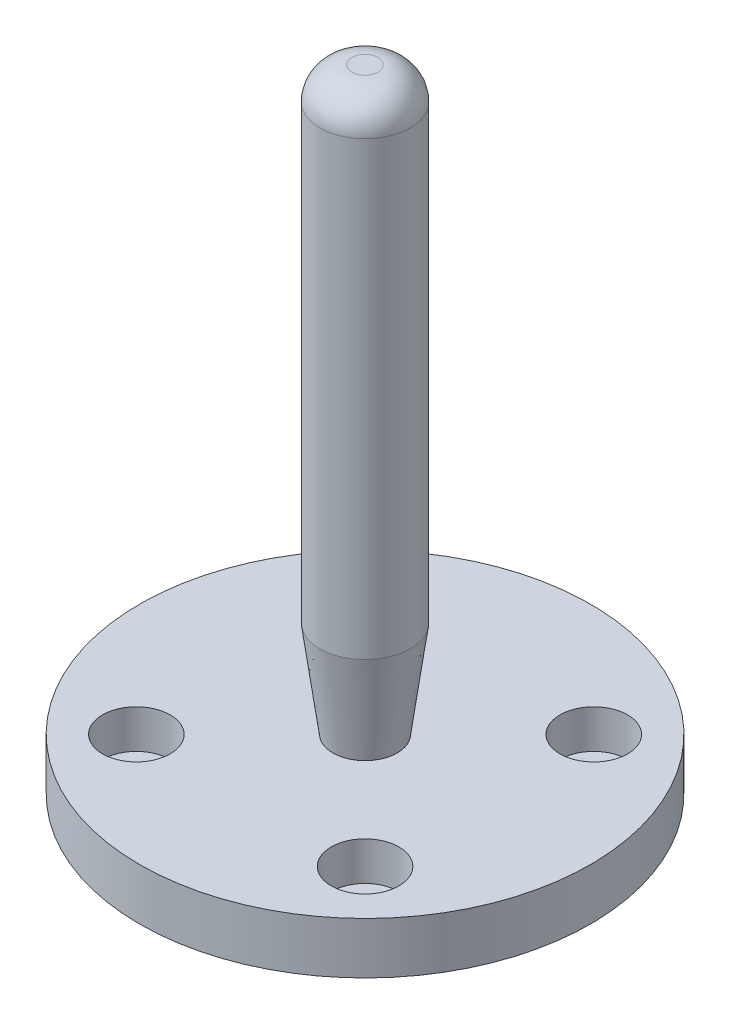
ISO-10303-21;
HEADER;
FILE_DESCRIPTION(('STEP AP214'),'2;1');
FILE_NAME('part.step','',(''),(''),'','','');
FILE_SCHEMA(('AUTOMOTIVE_DESIGN { 1 0 10303 214 1 1 1 1 }'));
ENDSEC;
DATA;
#1=APPLICATION_CONTEXT('core data for automotive mechanical design processes');
#2=APPLICATION_PROTOCOL_DEFINITION('international standard','automotive_design',2000,#1);
#3=PRODUCT_CONTEXT('',#1,'mechanical');
#4=PRODUCT('Part','Part','',(#3));
#5=PRODUCT_RELATED_PRODUCT_CATEGORY('part','',(#4));
#6=PRODUCT_DEFINITION_FORMATION('','',#4);
#7=PRODUCT_DEFINITION_CONTEXT('part definition',#1,'design');
#8=PRODUCT_DEFINITION('design','',#6,#7);
#9=PRODUCT_DEFINITION_SHAPE('','',#8);
#10=(LENGTH_UNIT() NAMED_UNIT(*) SI_UNIT(.MILLI.,.METRE.));
#11=(NAMED_UNIT(*) PLANE_ANGLE_UNIT() SI_UNIT($,.RADIAN.));
#12=(NAMED_UNIT(*) SI_UNIT($,.STERADIAN.) SOLID_ANGLE_UNIT());
#13=UNCERTAINTY_MEASURE_WITH_UNIT(LENGTH_MEASURE(1.E-05),#10,'distance_accuracy_value','');
#14=(GEOMETRIC_REPRESENTATION_CONTEXT(3) GLOBAL_UNCERTAINTY_ASSIGNED_CONTEXT((#13)) GLOBAL_UNIT_ASSIGNED_CONTEXT((#10,
#11,#12)) REPRESENTATION_CONTEXT('',''));
#15=CARTESIAN_POINT('',(0.,0.,0.));
#16=DIRECTION('',(0.,0.,1.));
#17=DIRECTION('',(1.,0.,0.));
#18=AXIS2_PLACEMENT_3D('',#15,#16,#17);
#19=CARTESIAN_POINT('',(0.,8.,0.));
#20=DIRECTION('',(0.,-1.,0.));
#21=DIRECTION('',(0.,0.,-1.));
#22=AXIS2_PLACEMENT_3D('',#19,#20,#21);
#23=CYLINDRICAL_SURFACE('',#22,35.);
#24=CARTESIAN_POINT('',(0.,8.,0.));
#25=DIRECTION('',(0.,1.,0.));
#26=DIRECTION('',(0.,0.,1.));
#27=AXIS2_PLACEMENT_3D('',#24,#25,#26);
#28=CIRCLE('',#27,35.);
#29=CARTESIAN_POINT('',(0.,8.,35.));
#30=VERTEX_POINT('',#29);
#31=EDGE_CURVE('E46',#30,#30,#28,.T.);
#32=ORIENTED_EDGE('',*,*,#31,.F.);
#33=EDGE_LOOP('',(#32));
#34=FACE_BOUND('',#33,.T.);
#35=CARTESIAN_POINT('',(0.,0.,0.));
#36=DIRECTION('',(0.,1.,0.));
#37=DIRECTION('',(0.,0.,1.));
#38=AXIS2_PLACEMENT_3D('',#35,#36,#37);
#39=CIRCLE('',#38,35.);
#40=CARTESIAN_POINT('',(0.,0.,35.));
#41=VERTEX_POINT('',#40);
#42=EDGE_CURVE('E49',#41,#41,#39,.T.);
#43=ORIENTED_EDGE('',*,*,#42,.T.);
#44=EDGE_LOOP('',(#43));
#45=FACE_BOUND('',#44,.T.);
#46=ADVANCED_FACE('F31',(#34,#45),#23,.T.);
#47=CARTESIAN_POINT('',(0.,8.,0.));
#48=DIRECTION('',(0.,1.,0.));
#49=DIRECTION('',(0.,0.,1.));
#50=AXIS2_PLACEMENT_3D('',#47,#48,#49);
#51=PLANE('',#50);
#52=CARTESIAN_POINT('',(0.,8.,0.));
#53=DIRECTION('',(0.,1.,0.));
#54=DIRECTION('',(0.,0.,1.));
#55=AXIS2_PLACEMENT_3D('',#52,#53,#54);
#56=CIRCLE('',#55,5.);
#57=CARTESIAN_POINT('',(0.,8.,5.));
#58=VERTEX_POINT('',#57);
#59=EDGE_CURVE('E42',#58,#58,#56,.T.);
#60=ORIENTED_EDGE('',*,*,#59,.F.);
#61=EDGE_LOOP('',(#60));
#62=FACE_BOUND('',#61,.T.);
#63=CARTESIAN_POINT('',(-17.75,8.,17.75));
#64=DIRECTION('',(0.,1.,0.));
#65=DIRECTION('',(0.,0.,1.));
#66=AXIS2_PLACEMENT_3D('',#63,#64,#65);
#67=CIRCLE('',#66,5.25);
#68=CARTESIAN_POINT('',(-17.75,8.,23.));
#69=VERTEX_POINT('',#68);
#70=EDGE_CURVE('E73',#69,#69,#67,.T.);
#71=ORIENTED_EDGE('',*,*,#70,.F.);
#72=EDGE_LOOP('',(#71));
#73=FACE_BOUND('',#72,.T.);
#74=CARTESIAN_POINT('',(17.75,8.,17.75));
#75=DIRECTION('',(0.,1.,0.));
#76=DIRECTION('',(0.,0.,1.));
#77=AXIS2_PLACEMENT_3D('',#74,#75,#76);
#78=CIRCLE('',#77,5.25);
#79=CARTESIAN_POINT('',(17.75,8.,23.));
#80=VERTEX_POINT('',#79);
#81=EDGE_CURVE('E67',#80,#80,#78,.T.);
#82=ORIENTED_EDGE('',*,*,#81,.F.);
#83=EDGE_LOOP('',(#82));
#84=FACE_BOUND('',#83,.T.);
#85=CARTESIAN_POINT('',(17.75,8.,-17.75));
#86=DIRECTION('',(0.,1.,0.));
#87=DIRECTION('',(0.,0.,1.));
#88=AXIS2_PLACEMENT_3D('',#85,#86,#87);
#89=CIRCLE('',#88,5.25);
#90=CARTESIAN_POINT('',(17.75,8.,-12.5));
#91=VERTEX_POINT('',#90);
#92=EDGE_CURVE('E61',#91,#91,#89,.T.);
#93=ORIENTED_EDGE('',*,*,#92,.F.);
#94=EDGE_LOOP('',(#93));
#95=FACE_BOUND('',#94,.T.);
#96=CARTESIAN_POINT('',(-17.75,8.,-17.75));
#97=DIRECTION('',(0.,1.,0.));
#98=DIRECTION('',(0.,0.,1.));
#99=AXIS2_PLACEMENT_3D('',#96,#97,#98);
#100=CIRCLE('',#99,5.25);
#101=CARTESIAN_POINT('',(-17.75,8.,-12.5));
#102=VERTEX_POINT('',#101);
#103=EDGE_CURVE('E55',#102,#102,#100,.T.);
#104=ORIENTED_EDGE('',*,*,#103,.F.);
#105=EDGE_LOOP('',(#104));
#106=FACE_BOUND('',#105,.T.);
#107=ORIENTED_EDGE('',*,*,#31,.T.);
#108=EDGE_LOOP('',(#107));
#109=FACE_BOUND('',#108,.T.);
#110=ADVANCED_FACE('F121',(#62,#73,#84,#95,#106,#109),#51,.T.);
#111=CARTESIAN_POINT('',(0.,0.,0.));
#112=DIRECTION('',(0.,1.,0.));
#113=DIRECTION('',(0.,0.,1.));
#114=AXIS2_PLACEMENT_3D('',#111,#112,#113);
#115=PLANE('',#114);
#116=CARTESIAN_POINT('',(17.75,0.,17.75));
#117=DIRECTION('',(0.,1.,0.));
#118=DIRECTION('',(0.,0.,1.));
#119=AXIS2_PLACEMENT_3D('',#116,#117,#118);
#120=CIRCLE('',#119,3.25);
#121=CARTESIAN_POINT('',(17.75,0.,21.));
#122=VERTEX_POINT('',#121);
#123=EDGE_CURVE('E94',#122,#122,#120,.T.);
#124=ORIENTED_EDGE('',*,*,#123,.T.);
#125=EDGE_LOOP('',(#124));
#126=FACE_BOUND('',#125,.T.);
#127=CARTESIAN_POINT('',(-17.75,0.,17.75));
#128=DIRECTION('',(0.,1.,0.));
#129=DIRECTION('',(0.,0.,1.));
#130=AXIS2_PLACEMENT_3D('',#127,#128,#129);
#131=CIRCLE('',#130,3.25);
#132=CARTESIAN_POINT('',(-17.75,0.,21.));
#133=VERTEX_POINT('',#132);
#134=EDGE_CURVE('E88',#133,#133,#131,.T.);
#135=ORIENTED_EDGE('',*,*,#134,.T.);
#136=EDGE_LOOP('',(#135));
#137=FACE_BOUND('',#136,.T.);
#138=CARTESIAN_POINT('',(-17.75,0.,-17.75));
#139=DIRECTION('',(0.,1.,0.));
#140=DIRECTION('',(0.,0.,1.));
#141=AXIS2_PLACEMENT_3D('',#138,#139,#140);
#142=CIRCLE('',#141,3.25);
#143=CARTESIAN_POINT('',(-17.75,0.,-14.5));
#144=VERTEX_POINT('',#143);
#145=EDGE_CURVE('E82',#144,#144,#142,.T.);
#146=ORIENTED_EDGE('',*,*,#145,.T.);
#147=EDGE_LOOP('',(#146));
#148=FACE_BOUND('',#147,.T.);
#149=CARTESIAN_POINT('',(17.75,0.,-17.75));
#150=DIRECTION('',(0.,1.,0.));
#151=DIRECTION('',(0.,0.,1.));
#152=AXIS2_PLACEMENT_3D('',#149,#150,#151);
#153=CIRCLE('',#152,3.25);
#154=CARTESIAN_POINT('',(17.75,0.,-14.5));
#155=VERTEX_POINT('',#154);
#156=EDGE_CURVE('E76',#155,#155,#153,.T.);
#157=ORIENTED_EDGE('',*,*,#156,.T.);
#158=EDGE_LOOP('',(#157));
#159=FACE_BOUND('',#158,.T.);
#160=ORIENTED_EDGE('',*,*,#42,.F.);
#161=EDGE_LOOP('',(#160));
#162=FACE_BOUND('',#161,.T.);
#163=ADVANCED_FACE('F126',(#126,#137,#148,#159,#162),#115,.F.);
#164=CARTESIAN_POINT('',(-17.75,2.,-17.75));
#165=DIRECTION('',(0.,1.,0.));
#166=DIRECTION('',(0.,0.,1.));
#167=AXIS2_PLACEMENT_3D('',#164,#165,#166);
#168=CYLINDRICAL_SURFACE('',#167,5.25);
#169=CARTESIAN_POINT('',(-17.75,2.,-17.75));
#170=DIRECTION('',(0.,1.,0.));
#171=DIRECTION('',(0.,0.,1.));
#172=AXIS2_PLACEMENT_3D('',#169,#170,#171);
#173=CIRCLE('',#172,5.25);
#174=CARTESIAN_POINT('',(-17.75,2.,-12.5));
#175=VERTEX_POINT('',#174);
#176=EDGE_CURVE('E52',#175,#175,#173,.T.);
#177=ORIENTED_EDGE('',*,*,#176,.F.);
#178=EDGE_LOOP('',(#177));
#179=FACE_BOUND('',#178,.T.);
#180=ORIENTED_EDGE('',*,*,#103,.T.);
#181=EDGE_LOOP('',(#180));
#182=FACE_BOUND('',#181,.T.);
#183=ADVANCED_FACE('F133',(#179,#182),#168,.F.);
#184=CARTESIAN_POINT('',(-17.75,2.,-17.75));
#185=DIRECTION('',(0.,1.,0.));
#186=DIRECTION('',(0.,0.,1.));
#187=AXIS2_PLACEMENT_3D('',#184,#185,#186);
#188=PLANE('',#187);
#189=CARTESIAN_POINT('',(-17.75,2.,-17.75));
#190=DIRECTION('',(0.,1.,0.));
#191=DIRECTION('',(0.,0.,1.));
#192=AXIS2_PLACEMENT_3D('',#189,#190,#191);
#193=CIRCLE('',#192,3.25);
#194=CARTESIAN_POINT('',(-17.75,2.,-14.5));
#195=VERTEX_POINT('',#194);
#196=EDGE_CURVE('E85',#195,#195,#193,.T.);
#197=ORIENTED_EDGE('',*,*,#196,.F.);
#198=EDGE_LOOP('',(#197));
#199=FACE_BOUND('',#198,.T.);
#200=ORIENTED_EDGE('',*,*,#176,.T.);
#201=EDGE_LOOP('',(#200));
#202=FACE_BOUND('',#201,.T.);
#203=ADVANCED_FACE('F138',(#199,#202),#188,.T.);
#204=CARTESIAN_POINT('',(17.75,2.,-17.75));
#205=DIRECTION('',(0.,1.,0.));
#206=DIRECTION('',(0.,0.,1.));
#207=AXIS2_PLACEMENT_3D('',#204,#205,#206);
#208=CYLINDRICAL_SURFACE('',#207,5.25);
#209=CARTESIAN_POINT('',(17.75,2.,-17.75));
#210=DIRECTION('',(0.,1.,0.));
#211=DIRECTION('',(0.,0.,1.));
#212=AXIS2_PLACEMENT_3D('',#209,#210,#211);
#213=CIRCLE('',#212,5.25);
#214=CARTESIAN_POINT('',(17.75,2.,-12.5));
#215=VERTEX_POINT('',#214);
#216=EDGE_CURVE('E58',#215,#215,#213,.T.);
#217=ORIENTED_EDGE('',*,*,#216,.F.);
#218=EDGE_LOOP('',(#217));
#219=FACE_BOUND('',#218,.T.);
#220=ORIENTED_EDGE('',*,*,#92,.T.);
#221=EDGE_LOOP('',(#220));
#222=FACE_BOUND('',#221,.T.);
#223=ADVANCED_FACE('F142',(#219,#222),#208,.F.);
#224=CARTESIAN_POINT('',(17.75,2.,-17.75));
#225=DIRECTION('',(0.,1.,0.));
#226=DIRECTION('',(0.,0.,1.));
#227=AXIS2_PLACEMENT_3D('',#224,#225,#226);
#228=PLANE('',#227);
#229=CARTESIAN_POINT('',(17.75,2.,-17.75));
#230=DIRECTION('',(0.,1.,0.));
#231=DIRECTION('',(0.,0.,1.));
#232=AXIS2_PLACEMENT_3D('',#229,#230,#231);
#233=CIRCLE('',#232,3.25);
#234=CARTESIAN_POINT('',(17.75,2.,-14.5));
#235=VERTEX_POINT('',#234);
#236=EDGE_CURVE('E79',#235,#235,#233,.T.);
#237=ORIENTED_EDGE('',*,*,#236,.F.);
#238=EDGE_LOOP('',(#237));
#239=FACE_BOUND('',#238,.T.);
#240=ORIENTED_EDGE('',*,*,#216,.T.);
#241=EDGE_LOOP('',(#240));
#242=FACE_BOUND('',#241,.T.);
#243=ADVANCED_FACE('F146',(#239,#242),#228,.T.);
#244=CARTESIAN_POINT('',(17.75,2.,17.75));
#245=DIRECTION('',(0.,1.,0.));
#246=DIRECTION('',(0.,0.,1.));
#247=AXIS2_PLACEMENT_3D('',#244,#245,#246);
#248=CYLINDRICAL_SURFACE('',#247,5.25);
#249=CARTESIAN_POINT('',(17.75,2.,17.75));
#250=DIRECTION('',(0.,1.,0.));
#251=DIRECTION('',(0.,0.,1.));
#252=AXIS2_PLACEMENT_3D('',#249,#250,#251);
#253=CIRCLE('',#252,5.25);
#254=CARTESIAN_POINT('',(17.75,2.,23.));
#255=VERTEX_POINT('',#254);
#256=EDGE_CURVE('E64',#255,#255,#253,.T.);
#257=ORIENTED_EDGE('',*,*,#256,.F.);
#258=EDGE_LOOP('',(#257));
#259=FACE_BOUND('',#258,.T.);
#260=ORIENTED_EDGE('',*,*,#81,.T.);
#261=EDGE_LOOP('',(#260));
#262=FACE_BOUND('',#261,.T.);
#263=ADVANCED_FACE('F150',(#259,#262),#248,.F.);
#264=CARTESIAN_POINT('',(17.75,2.,17.75));
#265=DIRECTION('',(0.,1.,0.));
#266=DIRECTION('',(0.,0.,1.));
#267=AXIS2_PLACEMENT_3D('',#264,#265,#266);
#268=PLANE('',#267);
#269=CARTESIAN_POINT('',(17.75,2.,17.75));
#270=DIRECTION('',(0.,1.,0.));
#271=DIRECTION('',(0.,0.,1.));
#272=AXIS2_PLACEMENT_3D('',#269,#270,#271);
#273=CIRCLE('',#272,3.25);
#274=CARTESIAN_POINT('',(17.75,2.,21.));
#275=VERTEX_POINT('',#274);
#276=EDGE_CURVE('E97',#275,#275,#273,.T.);
#277=ORIENTED_EDGE('',*,*,#276,.F.);
#278=EDGE_LOOP('',(#277));
#279=FACE_BOUND('',#278,.T.);
#280=ORIENTED_EDGE('',*,*,#256,.T.);
#281=EDGE_LOOP('',(#280));
#282=FACE_BOUND('',#281,.T.);
#283=ADVANCED_FACE('F154',(#279,#282),#268,.T.);
#284=CARTESIAN_POINT('',(-17.75,2.,17.75));
#285=DIRECTION('',(0.,1.,0.));
#286=DIRECTION('',(0.,0.,1.));
#287=AXIS2_PLACEMENT_3D('',#284,#285,#286);
#288=CYLINDRICAL_SURFACE('',#287,5.25);
#289=CARTESIAN_POINT('',(-17.75,2.,17.75));
#290=DIRECTION('',(0.,1.,0.));
#291=DIRECTION('',(0.,0.,1.));
#292=AXIS2_PLACEMENT_3D('',#289,#290,#291);
#293=CIRCLE('',#292,5.25);
#294=CARTESIAN_POINT('',(-17.75,2.,23.));
#295=VERTEX_POINT('',#294);
#296=EDGE_CURVE('E70',#295,#295,#293,.T.);
#297=ORIENTED_EDGE('',*,*,#296,.F.);
#298=EDGE_LOOP('',(#297));
#299=FACE_BOUND('',#298,.T.);
#300=ORIENTED_EDGE('',*,*,#70,.T.);
#301=EDGE_LOOP('',(#300));
#302=FACE_BOUND('',#301,.T.);
#303=ADVANCED_FACE('F158',(#299,#302),#288,.F.);
#304=CARTESIAN_POINT('',(-17.75,2.,17.75));
#305=DIRECTION('',(0.,1.,0.));
#306=DIRECTION('',(0.,0.,1.));
#307=AXIS2_PLACEMENT_3D('',#304,#305,#306);
#308=PLANE('',#307);
#309=CARTESIAN_POINT('',(-17.75,2.,17.75));
#310=DIRECTION('',(0.,1.,0.));
#311=DIRECTION('',(0.,0.,1.));
#312=AXIS2_PLACEMENT_3D('',#309,#310,#311);
#313=CIRCLE('',#312,3.25);
#314=CARTESIAN_POINT('',(-17.75,2.,21.));
#315=VERTEX_POINT('',#314);
#316=EDGE_CURVE('E91',#315,#315,#313,.T.);
#317=ORIENTED_EDGE('',*,*,#316,.F.);
#318=EDGE_LOOP('',(#317));
#319=FACE_BOUND('',#318,.T.);
#320=ORIENTED_EDGE('',*,*,#296,.T.);
#321=EDGE_LOOP('',(#320));
#322=FACE_BOUND('',#321,.T.);
#323=ADVANCED_FACE('F162',(#319,#322),#308,.T.);
#324=CARTESIAN_POINT('',(17.75,0.,-17.75));
#325=DIRECTION('',(0.,1.,0.));
#326=DIRECTION('',(0.,0.,1.));
#327=AXIS2_PLACEMENT_3D('',#324,#325,#326);
#328=CYLINDRICAL_SURFACE('',#327,3.25);
#329=ORIENTED_EDGE('',*,*,#156,.F.);
#330=EDGE_LOOP('',(#329));
#331=FACE_BOUND('',#330,.T.);
#332=ORIENTED_EDGE('',*,*,#236,.T.);
#333=EDGE_LOOP('',(#332));
#334=FACE_BOUND('',#333,.T.);
#335=ADVANCED_FACE('F166',(#331,#334),#328,.F.);
#336=CARTESIAN_POINT('',(-17.75,0.,-17.75));
#337=DIRECTION('',(0.,1.,0.));
#338=DIRECTION('',(0.,0.,1.));
#339=AXIS2_PLACEMENT_3D('',#336,#337,#338);
#340=CYLINDRICAL_SURFACE('',#339,3.25);
#341=ORIENTED_EDGE('',*,*,#145,.F.);
#342=EDGE_LOOP('',(#341));
#343=FACE_BOUND('',#342,.T.);
#344=ORIENTED_EDGE('',*,*,#196,.T.);
#345=EDGE_LOOP('',(#344));
#346=FACE_BOUND('',#345,.T.);
#347=ADVANCED_FACE('F170',(#343,#346),#340,.F.);
#348=CARTESIAN_POINT('',(-17.75,0.,17.75));
#349=DIRECTION('',(0.,1.,0.));
#350=DIRECTION('',(0.,0.,1.));
#351=AXIS2_PLACEMENT_3D('',#348,#349,#350);
#352=CYLINDRICAL_SURFACE('',#351,3.25);
#353=ORIENTED_EDGE('',*,*,#134,.F.);
#354=EDGE_LOOP('',(#353));
#355=FACE_BOUND('',#354,.T.);
#356=ORIENTED_EDGE('',*,*,#316,.T.);
#357=EDGE_LOOP('',(#356));
#358=FACE_BOUND('',#357,.T.);
#359=ADVANCED_FACE('F174',(#355,#358),#352,.F.);
#360=CARTESIAN_POINT('',(17.75,0.,17.75));
#361=DIRECTION('',(0.,1.,0.));
#362=DIRECTION('',(0.,0.,1.));
#363=AXIS2_PLACEMENT_3D('',#360,#361,#362);
#364=CYLINDRICAL_SURFACE('',#363,3.25);
#365=ORIENTED_EDGE('',*,*,#123,.F.);
#366=EDGE_LOOP('',(#365));
#367=FACE_BOUND('',#366,.T.);
#368=ORIENTED_EDGE('',*,*,#276,.T.);
#369=EDGE_LOOP('',(#368));
#370=FACE_BOUND('',#369,.T.);
#371=ADVANCED_FACE('F118',(#367,#370),#364,.F.);
#372=CARTESIAN_POINT('',(0.,98.,0.));
#373=DIRECTION('',(0.,1.,0.));
#374=DIRECTION('',(0.,0.,1.));
#375=AXIS2_PLACEMENT_3D('',#372,#373,#374);
#376=PLANE('',#375);
#377=CARTESIAN_POINT('',(0.,98.,0.));
#378=DIRECTION('',(0.,1.,0.));
#379=DIRECTION('',(0.,0.,1.));
#380=AXIS2_PLACEMENT_3D('',#377,#378,#379);
#381=CIRCLE('',#380,2.);
#382=CARTESIAN_POINT('',(0.,98.,2.));
#383=VERTEX_POINT('',#382);
#384=EDGE_CURVE('E10',#383,#383,#381,.T.);
#385=ORIENTED_EDGE('',*,*,#384,.T.);
#386=EDGE_LOOP('',(#385));
#387=FACE_BOUND('',#386,.T.);
#388=ADVANCED_FACE('F111',(#387),#376,.T.);
#389=CARTESIAN_POINT('',(0.,8.,0.));
#390=DIRECTION('',(0.,-1.,0.));
#391=DIRECTION('',(0.,0.,-1.));
#392=AXIS2_PLACEMENT_3D('',#389,#390,#391);
#393=CYLINDRICAL_SURFACE('',#392,7.);
#394=CARTESIAN_POINT('',(0.,93.,0.));
#395=DIRECTION('',(0.,1.,0.));
#396=DIRECTION('',(0.,0.,1.));
#397=AXIS2_PLACEMENT_3D('',#394,#395,#396);
#398=CIRCLE('',#397,7.);
#399=CARTESIAN_POINT('',(0.,93.,7.));
#400=VERTEX_POINT('',#399);
#401=EDGE_CURVE('E38',#400,#400,#398,.F.);
#402=ORIENTED_EDGE('',*,*,#401,.T.);
#403=EDGE_LOOP('',(#402));
#404=FACE_BOUND('',#403,.T.);
#405=CARTESIAN_POINT('',(0.,23.,0.));
#406=DIRECTION('',(0.,-1.,0.));
#407=DIRECTION('',(0.,0.,-1.));
#408=AXIS2_PLACEMENT_3D('',#405,#406,#407);
#409=CIRCLE('',#408,7.00000000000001);
#410=CARTESIAN_POINT('',(0.,23.,-7.00000000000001));
#411=VERTEX_POINT('',#410);
#412=EDGE_CURVE('E100',#411,#411,#409,.T.);
#413=ORIENTED_EDGE('',*,*,#412,.F.);
#414=EDGE_LOOP('',(#413));
#415=FACE_BOUND('',#414,.T.);
#416=ADVANCED_FACE('F109',(#404,#415),#393,.T.);
#417=CARTESIAN_POINT('',(0.,8.00000000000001,0.));
#418=DIRECTION('',(0.,1.,0.));
#419=DIRECTION('',(0.,0.,1.));
#420=AXIS2_PLACEMENT_3D('',#417,#418,#419);
#421=CONICAL_SURFACE('',#420,5.,0.132551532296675);
#422=ORIENTED_EDGE('',*,*,#412,.T.);
#423=EDGE_LOOP('',(#422));
#424=FACE_BOUND('',#423,.T.);
#425=ORIENTED_EDGE('',*,*,#59,.T.);
#426=EDGE_LOOP('',(#425));
#427=FACE_BOUND('',#426,.T.);
#428=ADVANCED_FACE('F106',(#424,#427),#421,.T.);
#429=CARTESIAN_POINT('',(0.,93.,0.));
#430=DIRECTION('',(0.,1.,0.));
#431=DIRECTION('',(0.,0.,1.));
#432=AXIS2_PLACEMENT_3D('',#429,#430,#431);
#433=DEGENERATE_TOROIDAL_SURFACE('',#432,2.,5.,.T.);
#434=ORIENTED_EDGE('',*,*,#384,.F.);
#435=EDGE_LOOP('',(#434));
#436=FACE_BOUND('',#435,.T.);
#437=ORIENTED_EDGE('',*,*,#401,.F.);
#438=EDGE_LOOP('',(#437));
#439=FACE_BOUND('',#438,.T.);
#440=ADVANCED_FACE('F33',(#436,#439),#433,.T.);
#441=CLOSED_SHELL('',(#46,#110,#163,#183,#203,#223,#243,#263,#283,#303,#323,#335,#347,#359,#371,
#388,#416,#428,#440));
#442=MANIFOLD_SOLID_BREP('B2',#441);
#443=ADVANCED_BREP_SHAPE_REPRESENTATION('',(#18,#442),#14);
#444=SHAPE_DEFINITION_REPRESENTATION(#9,#443);
ENDSEC;
END-ISO-10303-21;
